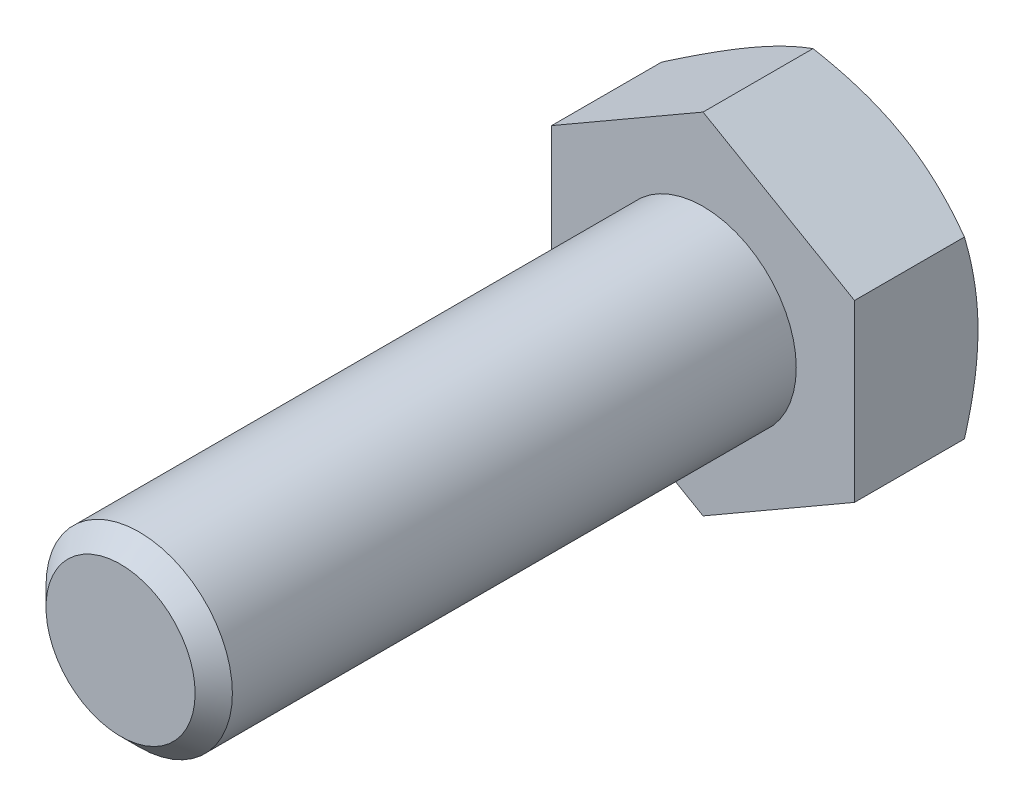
ISO-10303-21;
HEADER;
FILE_DESCRIPTION(('STEP AP214'),'2;1');
FILE_NAME('part.step','',(''),(''),'','','');
FILE_SCHEMA(('AUTOMOTIVE_DESIGN { 1 0 10303 214 1 1 1 1 }'));
ENDSEC;
DATA;
#1=APPLICATION_CONTEXT('core data for automotive mechanical design processes');
#2=APPLICATION_PROTOCOL_DEFINITION('international standard','automotive_design',2000,#1);
#3=PRODUCT_CONTEXT('',#1,'mechanical');
#4=PRODUCT('Part','Part','',(#3));
#5=PRODUCT_RELATED_PRODUCT_CATEGORY('part','',(#4));
#6=PRODUCT_DEFINITION_FORMATION('','',#4);
#7=PRODUCT_DEFINITION_CONTEXT('part definition',#1,'design');
#8=PRODUCT_DEFINITION('design','',#6,#7);
#9=PRODUCT_DEFINITION_SHAPE('','',#8);
#10=(LENGTH_UNIT() NAMED_UNIT(*) SI_UNIT(.MILLI.,.METRE.));
#11=(NAMED_UNIT(*) PLANE_ANGLE_UNIT() SI_UNIT($,.RADIAN.));
#12=(NAMED_UNIT(*) SI_UNIT($,.STERADIAN.) SOLID_ANGLE_UNIT());
#13=UNCERTAINTY_MEASURE_WITH_UNIT(LENGTH_MEASURE(1.E-05),#10,'distance_accuracy_value','');
#14=(GEOMETRIC_REPRESENTATION_CONTEXT(3) GLOBAL_UNCERTAINTY_ASSIGNED_CONTEXT((#13)) GLOBAL_UNIT_ASSIGNED_CONTEXT((#10,
#11,#12)) REPRESENTATION_CONTEXT('',''));
#15=CARTESIAN_POINT('',(0.,0.,0.));
#16=DIRECTION('',(0.,0.,1.));
#17=DIRECTION('',(1.,0.,0.));
#18=AXIS2_PLACEMENT_3D('',#15,#16,#17);
#19=CARTESIAN_POINT('',(0.,0.,25.));
#20=DIRECTION('',(0.,0.,1.));
#21=DIRECTION('',(1.,0.,0.));
#22=AXIS2_PLACEMENT_3D('',#19,#20,#21);
#23=PLANE('',#22);
#24=CARTESIAN_POINT('',(0.,0.,25.));
#25=DIRECTION('',(0.,0.,1.));
#26=DIRECTION('',(1.,0.,0.));
#27=AXIS2_PLACEMENT_3D('',#24,#25,#26);
#28=CIRCLE('',#27,3.2);
#29=CARTESIAN_POINT('',(3.20000000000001,0.,25.));
#30=VERTEX_POINT('',#29);
#31=EDGE_CURVE('E205',#30,#30,#28,.T.);
#32=ORIENTED_EDGE('',*,*,#31,.T.);
#33=EDGE_LOOP('',(#32));
#34=FACE_BOUND('',#33,.T.);
#35=ADVANCED_FACE('F31',(#34),#23,.T.);
#36=CARTESIAN_POINT('',(0.,0.,0.));
#37=DIRECTION('',(0.,0.,1.));
#38=DIRECTION('',(1.,0.,0.));
#39=AXIS2_PLACEMENT_3D('',#36,#37,#38);
#40=CYLINDRICAL_SURFACE('',#39,4.);
#41=CARTESIAN_POINT('',(0.,0.,24.2));
#42=DIRECTION('',(0.,0.,1.));
#43=DIRECTION('',(1.,0.,0.));
#44=AXIS2_PLACEMENT_3D('',#41,#42,#43);
#45=CIRCLE('',#44,4.);
#46=CARTESIAN_POINT('',(4.,0.,24.2));
#47=VERTEX_POINT('',#46);
#48=EDGE_CURVE('E207',#47,#47,#45,.F.);
#49=ORIENTED_EDGE('',*,*,#48,.T.);
#50=EDGE_LOOP('',(#49));
#51=FACE_BOUND('',#50,.T.);
#52=CARTESIAN_POINT('',(0.,0.,0.));
#53=DIRECTION('',(0.,0.,1.));
#54=DIRECTION('',(1.,0.,0.));
#55=AXIS2_PLACEMENT_3D('',#52,#53,#54);
#56=CIRCLE('',#55,4.);
#57=CARTESIAN_POINT('',(4.,0.,0.));
#58=VERTEX_POINT('',#57);
#59=EDGE_CURVE('E208',#58,#58,#56,.F.);
#60=ORIENTED_EDGE('',*,*,#59,.F.);
#61=EDGE_LOOP('',(#60));
#62=FACE_BOUND('',#61,.T.);
#63=ADVANCED_FACE('F196',(#51,#62),#40,.T.);
#64=CARTESIAN_POINT('',(0.,0.,25.));
#65=DIRECTION('',(0.,0.,-1.));
#66=DIRECTION('',(-1.,0.,0.));
#67=AXIS2_PLACEMENT_3D('',#64,#65,#66);
#68=CONICAL_SURFACE('',#67,3.2,0.785398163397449);
#69=ORIENTED_EDGE('',*,*,#48,.F.);
#70=EDGE_LOOP('',(#69));
#71=FACE_BOUND('',#70,.T.);
#72=ORIENTED_EDGE('',*,*,#31,.F.);
#73=EDGE_LOOP('',(#72));
#74=FACE_BOUND('',#73,.T.);
#75=ADVANCED_FACE('F201',(#71,#74),#68,.T.);
#76=CARTESIAN_POINT('',(0.,7.50555349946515,-5.3));
#77=DIRECTION('',(0.499999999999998,0.86602540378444,0.));
#78=DIRECTION('',(-0.86602540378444,0.499999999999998,0.));
#79=AXIS2_PLACEMENT_3D('',#76,#77,#78);
#80=PLANE('',#79);
#81=CARTESIAN_POINT('',(-0.000200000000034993,7.50566896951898,-4.71937674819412));
#82=CARTESIAN_POINT('',(0.142677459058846,7.42317863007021,-4.76699557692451));
#83=CARTESIAN_POINT('',(0.286087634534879,7.34038072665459,-4.81245329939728));
#84=CARTESIAN_POINT('',(0.574072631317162,7.17411251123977,-4.89845131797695));
#85=CARTESIAN_POINT('',(0.718647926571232,7.09064192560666,-4.93898949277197));
#86=CARTESIAN_POINT('',(1.15468865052,6.8388936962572,-5.05242899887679));
#87=CARTESIAN_POINT('',(1.44787528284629,6.66962231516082,-5.11695219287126));
#88=CARTESIAN_POINT('',(1.88662374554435,6.41631077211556,-5.19261341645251));
#89=CARTESIAN_POINT('',(2.03087463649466,6.33302748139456,-5.21416714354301));
#90=CARTESIAN_POINT('',(2.32002821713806,6.16608458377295,-5.25030968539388));
#91=CARTESIAN_POINT('',(2.46493084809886,6.08242501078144,-5.26489911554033));
#92=CARTESIAN_POINT('',(2.7549877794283,5.91496056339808,-5.28674124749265));
#93=CARTESIAN_POINT('',(2.90014160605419,5.83115596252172,-5.29400227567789));
#94=CARTESIAN_POINT('',(3.19057533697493,5.66347396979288,-5.30103969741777));
#95=CARTESIAN_POINT('',(3.33585523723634,5.57959658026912,-5.30081632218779));
#96=CARTESIAN_POINT('',(3.73387594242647,5.34979921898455,-5.28991654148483));
#97=CARTESIAN_POINT('',(3.98648646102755,5.20395446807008,-5.27161818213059));
#98=CARTESIAN_POINT('',(4.49002967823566,4.91323365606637,-5.21359365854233));
#99=CARTESIAN_POINT('',(4.74096060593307,4.76835861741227,-5.17384766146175));
#100=CARTESIAN_POINT('',(5.24551722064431,4.47705272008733,-5.07449409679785));
#101=CARTESIAN_POINT('',(5.49907924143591,4.33065861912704,-5.01446557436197));
#102=CARTESIAN_POINT('',(6.00242193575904,4.04005357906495,-4.87822500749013));
#103=CARTESIAN_POINT('',(6.25220905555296,3.89583891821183,-4.8020449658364));
#104=CARTESIAN_POINT('',(6.5002,3.75266127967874,-4.71937674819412));
#105=B_SPLINE_CURVE_WITH_KNOTS('',3,(#81,#82,#83,#84,#85,#86,#87,#88,#89,#90,#91,#92,#93,#94,
#95,#96,#97,#98,#99,#100,#101,#102,#103,#104),.UNSPECIFIED.,.F.,.F.,(4,2,2,2,2,2,2,2,2,2,2,4),
(0.,0.51510505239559,1.03043143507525,2.06322554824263,2.56697389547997,3.07067772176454,
3.57380860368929,4.07692394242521,4.95279354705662,5.82947446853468,6.72559912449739,
7.61996451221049),.UNSPECIFIED.);
#106=CARTESIAN_POINT('',(0.,7.50555349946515,-4.71944341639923));
#107=VERTEX_POINT('',#106);
#108=CARTESIAN_POINT('',(3.24999999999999,5.62916512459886,-5.3));
#109=VERTEX_POINT('',#108);
#110=EDGE_CURVE('E241',#107,#109,#105,.T.);
#111=ORIENTED_EDGE('',*,*,#110,.F.);
#112=DIRECTION('',(0.,0.,1.));
#113=VECTOR('',#112,1.);
#114=CARTESIAN_POINT('',(0.,7.50555349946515,-5.3));
#115=LINE('',#114,#113);
#116=CARTESIAN_POINT('',(0.,7.50555349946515,0.));
#117=VERTEX_POINT('',#116);
#118=EDGE_CURVE('E215',#107,#117,#115,.T.);
#119=ORIENTED_EDGE('',*,*,#118,.T.);
#120=DIRECTION('',(-0.86602540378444,0.499999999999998,0.));
#121=VECTOR('',#120,1.);
#122=CARTESIAN_POINT('',(0.,7.50555349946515,0.));
#123=LINE('',#122,#121);
#124=CARTESIAN_POINT('',(6.5,3.75277674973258,0.));
#125=VERTEX_POINT('',#124);
#126=EDGE_CURVE('E239',#125,#117,#123,.T.);
#127=ORIENTED_EDGE('',*,*,#126,.F.);
#128=DIRECTION('',(0.,0.,1.));
#129=VECTOR('',#128,1.);
#130=CARTESIAN_POINT('',(6.5,3.75277674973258,-5.3));
#131=LINE('',#130,#129);
#132=CARTESIAN_POINT('',(6.5,3.75277674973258,-4.71944341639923));
#133=VERTEX_POINT('',#132);
#134=EDGE_CURVE('E212',#133,#125,#131,.T.);
#135=ORIENTED_EDGE('',*,*,#134,.F.);
#136=EDGE_CURVE('E171',#109,#133,#105,.T.);
#137=ORIENTED_EDGE('',*,*,#136,.F.);
#138=EDGE_LOOP('',(#111,#119,#127,#135,#137));
#139=FACE_BOUND('',#138,.T.);
#140=ADVANCED_FACE('F181',(#139),#80,.T.);
#141=CARTESIAN_POINT('',(6.5,-3.75277674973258,-5.3));
#142=DIRECTION('',(1.,0.,0.));
#143=DIRECTION('',(0.,0.,-1.));
#144=AXIS2_PLACEMENT_3D('',#141,#142,#143);
#145=PLANE('',#144);
#146=CARTESIAN_POINT('',(6.5,-10.2428264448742,-2.04883753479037));
#147=CARTESIAN_POINT('',(6.5,-9.95749123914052,-2.18789595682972));
#148=CARTESIAN_POINT('',(6.5,-9.67151814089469,-2.32566707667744));
#149=CARTESIAN_POINT('',(6.5,-9.09795746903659,-2.59791370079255));
#150=CARTESIAN_POINT('',(6.5,-8.81036966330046,-2.73238871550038));
#151=CARTESIAN_POINT('',(6.5,-8.23183597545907,-2.99796413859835));
#152=CARTESIAN_POINT('',(6.5,-7.94088042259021,-3.12904355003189));
#153=CARTESIAN_POINT('',(6.5,-7.35671087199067,-3.38604980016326));
#154=CARTESIAN_POINT('',(6.5,-7.06349697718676,-3.51197687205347));
#155=CARTESIAN_POINT('',(6.5,-6.46434920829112,-3.7614858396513));
#156=CARTESIAN_POINT('',(6.5,-6.15832132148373,-3.8848431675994));
#157=CARTESIAN_POINT('',(6.5,-5.54274557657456,-4.12260875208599));
#158=CARTESIAN_POINT('',(6.5,-5.23319733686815,-4.2370160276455));
#159=CARTESIAN_POINT('',(6.5,-4.61061796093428,-4.45399730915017));
#160=CARTESIAN_POINT('',(6.5,-4.29759477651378,-4.55659391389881));
#161=CARTESIAN_POINT('',(6.5,-3.66705774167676,-4.74676876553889));
#162=CARTESIAN_POINT('',(6.5,-3.34954528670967,-4.83435157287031));
#163=CARTESIAN_POINT('',(6.5,-2.71162315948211,-4.98994277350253));
#164=CARTESIAN_POINT('',(6.5,-2.3912406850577,-5.05806094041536));
#165=CARTESIAN_POINT('',(6.5,-1.74628166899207,-5.17096432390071));
#166=CARTESIAN_POINT('',(6.5,-1.4217055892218,-5.2157520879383));
#167=CARTESIAN_POINT('',(6.5,-0.935153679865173,-5.26247031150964));
#168=CARTESIAN_POINT('',(6.5,-0.774120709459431,-5.27461755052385));
#169=CARTESIAN_POINT('',(6.5,-0.451677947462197,-5.29209027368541));
#170=CARTESIAN_POINT('',(6.5,-0.290268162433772,-5.29741587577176));
#171=CARTESIAN_POINT('',(6.5,0.032631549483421,-5.30111032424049));
#172=CARTESIAN_POINT('',(6.5,0.194121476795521,-5.29947913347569));
#173=CARTESIAN_POINT('',(6.5,0.516885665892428,-5.28930353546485));
#174=CARTESIAN_POINT('',(6.5,0.678159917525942,-5.2807588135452));
#175=CARTESIAN_POINT('',(6.5,1.06087214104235,-5.2524625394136));
#176=CARTESIAN_POINT('',(6.5,1.28209274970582,-5.22970222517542));
#177=CARTESIAN_POINT('',(6.5,1.72298724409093,-5.17237790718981));
#178=CARTESIAN_POINT('',(6.5,1.94266093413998,-5.13781243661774));
#179=CARTESIAN_POINT('',(6.5,2.59905068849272,-5.01823337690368));
#180=CARTESIAN_POINT('',(6.5,3.03292018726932,-4.91735524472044));
#181=CARTESIAN_POINT('',(6.5,3.68203059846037,-4.74117763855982));
#182=CARTESIAN_POINT('',(6.5,3.90060192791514,-4.67743243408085));
#183=CARTESIAN_POINT('',(6.5,4.33562456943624,-4.54301317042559));
#184=CARTESIAN_POINT('',(6.5,4.55207586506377,-4.47233905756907));
#185=CARTESIAN_POINT('',(6.5,4.98292314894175,-4.3252213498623));
#186=CARTESIAN_POINT('',(6.5,5.19731969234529,-4.24877936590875));
#187=CARTESIAN_POINT('',(6.5,5.6243136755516,-4.09105605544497));
#188=CARTESIAN_POINT('',(6.5,5.8369111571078,-4.00977484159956));
#189=CARTESIAN_POINT('',(6.5,6.41107024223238,-3.78396124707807));
#190=CARTESIAN_POINT('',(6.5,6.77109993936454,-3.63553740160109));
#191=CARTESIAN_POINT('',(6.5,7.48742894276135,-3.32991367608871));
#192=CARTESIAN_POINT('',(6.5,7.84372782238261,-3.17271280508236));
#193=CARTESIAN_POINT('',(6.5,8.55345570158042,-2.85162072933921));
#194=CARTESIAN_POINT('',(6.5,8.90688352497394,-2.68772693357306));
#195=CARTESIAN_POINT('',(6.5,9.61131133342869,-2.35485675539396));
#196=CARTESIAN_POINT('',(6.5,9.96231141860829,-2.18588058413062));
#197=CARTESIAN_POINT('',(6.5,10.6629371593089,-1.84367823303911));
#198=CARTESIAN_POINT('',(6.5,11.012559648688,-1.67044558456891));
#199=CARTESIAN_POINT('',(6.5,11.7102232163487,-1.32082260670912));
#200=CARTESIAN_POINT('',(6.5,12.058264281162,-1.14443225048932));
#201=CARTESIAN_POINT('',(6.5,12.7529700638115,-0.789156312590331));
#202=CARTESIAN_POINT('',(6.5,13.099635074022,-0.610271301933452));
#203=CARTESIAN_POINT('',(6.5,13.7918918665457,-0.250435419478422));
#204=CARTESIAN_POINT('',(6.5,14.1374836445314,-0.0694845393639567));
#205=CARTESIAN_POINT('',(6.5,15.099399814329,0.437179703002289));
#206=CARTESIAN_POINT('',(6.5,15.7147468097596,0.764748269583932));
#207=CARTESIAN_POINT('',(6.5,16.9433793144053,1.42381233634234));
#208=CARTESIAN_POINT('',(6.5,17.5566646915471,1.7553080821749));
#209=CARTESIAN_POINT('',(6.5,18.7795711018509,2.4200871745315));
#210=CARTESIAN_POINT('',(6.5,19.389197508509,2.75336064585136));
#211=CARTESIAN_POINT('',(6.5,20.6071616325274,3.42213981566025));
#212=CARTESIAN_POINT('',(6.5,21.2154994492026,3.75764533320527));
#213=CARTESIAN_POINT('',(6.5,21.8233856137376,4.09396124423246));
#214=B_SPLINE_CURVE_WITH_KNOTS('',3,(#146,#147,#148,#149,#150,#151,#152,#153,#154,#155,#156,
#157,#158,#159,#160,#161,#162,#163,#164,#165,#166,#167,#168,#169,#170,#171,#172,#173,#174,#175,
#176,#177,#178,#179,#180,#181,#182,#183,#184,#185,#186,#187,#188,#189,#190,#191,#192,#193,#194,
#195,#196,#197,#198,#199,#200,#201,#202,#203,#204,#205,#206,#207,#208,#209,#210,#211,#212,#213),
.UNSPECIFIED.,.F.,.F.,(4,2,2,2,2,2,2,2,2,2,2,2,2,2,2,2,2,2,2,2,2,2,2,2,2,2,2,2,2,2,2,2,2,4),(0.,
0.952261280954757,1.90466315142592,2.8619801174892,3.81925370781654,4.8090096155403,
5.798873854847,6.78681142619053,7.77444837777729,8.75640022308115,9.7382448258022,
10.2225937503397,10.7069343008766,11.1912774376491,11.6756426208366,12.3424346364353,
13.0093095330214,14.3437044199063,15.0266742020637,15.7096492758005,16.3924343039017,
17.0752034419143,18.2433007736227,19.4115302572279,20.580216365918,21.748853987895,
22.9193933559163,24.0899426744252,25.2602283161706,26.4305186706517,28.5218066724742,
30.6132261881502,32.6975528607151,34.7817125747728),.UNSPECIFIED.);
#215=CARTESIAN_POINT('',(6.5,0.,-5.3));
#216=VERTEX_POINT('',#215);
#217=EDGE_CURVE('E169',#133,#216,#214,.F.);
#218=ORIENTED_EDGE('',*,*,#217,.F.);
#219=ORIENTED_EDGE('',*,*,#134,.T.);
#220=DIRECTION('',(0.,1.,0.));
#221=VECTOR('',#220,1.);
#222=CARTESIAN_POINT('',(6.5,-3.75277674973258,0.));
#223=LINE('',#222,#221);
#224=CARTESIAN_POINT('',(6.5,-3.75277674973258,0.));
#225=VERTEX_POINT('',#224);
#226=EDGE_CURVE('E217',#225,#125,#223,.T.);
#227=ORIENTED_EDGE('',*,*,#226,.F.);
#228=DIRECTION('',(0.,0.,1.));
#229=VECTOR('',#228,1.);
#230=CARTESIAN_POINT('',(6.5,-3.75277674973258,-5.3));
#231=LINE('',#230,#229);
#232=CARTESIAN_POINT('',(6.5,-3.75277674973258,-4.71944341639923));
#233=VERTEX_POINT('',#232);
#234=EDGE_CURVE('E223',#233,#225,#231,.T.);
#235=ORIENTED_EDGE('',*,*,#234,.F.);
#236=EDGE_CURVE('E164',#216,#233,#214,.F.);
#237=ORIENTED_EDGE('',*,*,#236,.F.);
#238=EDGE_LOOP('',(#218,#219,#227,#235,#237));
#239=FACE_BOUND('',#238,.T.);
#240=ADVANCED_FACE('F177',(#239),#145,.T.);
#241=CARTESIAN_POINT('',(0.,-7.50555349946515,-5.3));
#242=DIRECTION('',(0.499999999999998,-0.86602540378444,0.));
#243=DIRECTION('',(0.86602540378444,0.499999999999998,0.));
#244=AXIS2_PLACEMENT_3D('',#241,#242,#243);
#245=PLANE('',#244);
#246=CARTESIAN_POINT('',(6.5002,-3.75266127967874,-4.71937674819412));
#247=CARTESIAN_POINT('',(6.35732254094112,-3.83515161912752,-4.76699557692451));
#248=CARTESIAN_POINT('',(6.21391236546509,-3.91794952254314,-4.81245329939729));
#249=CARTESIAN_POINT('',(5.9259273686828,-4.08421773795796,-4.89845131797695));
#250=CARTESIAN_POINT('',(5.78135207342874,-4.16768832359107,-4.93898949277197));
#251=CARTESIAN_POINT('',(5.34531134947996,-4.41943655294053,-5.05242899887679));
#252=CARTESIAN_POINT('',(5.05212471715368,-4.58870793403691,-5.11695219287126));
#253=CARTESIAN_POINT('',(4.61337625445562,-4.84201947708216,-5.19261341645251));
#254=CARTESIAN_POINT('',(4.4691253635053,-4.92530276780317,-5.21416714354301));
#255=CARTESIAN_POINT('',(4.1799717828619,-5.09224566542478,-5.25030968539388));
#256=CARTESIAN_POINT('',(4.0350691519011,-5.17590523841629,-5.26489911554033));
#257=CARTESIAN_POINT('',(3.74501222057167,-5.34336968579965,-5.28674124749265));
#258=CARTESIAN_POINT('',(3.59985839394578,-5.42717428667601,-5.29400227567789));
#259=CARTESIAN_POINT('',(3.30942466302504,-5.59485627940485,-5.30103969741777));
#260=CARTESIAN_POINT('',(3.16414476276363,-5.67873366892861,-5.3008163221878));
#261=CARTESIAN_POINT('',(2.76612405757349,-5.90853103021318,-5.28991654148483));
#262=CARTESIAN_POINT('',(2.51351353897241,-6.05437578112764,-5.27161818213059));
#263=CARTESIAN_POINT('',(2.0099703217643,-6.34509659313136,-5.21359365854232));
#264=CARTESIAN_POINT('',(1.7590393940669,-6.48997163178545,-5.17384766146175));
#265=CARTESIAN_POINT('',(1.25448277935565,-6.78127752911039,-5.07449409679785));
#266=CARTESIAN_POINT('',(1.00092075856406,-6.92767163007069,-5.01446557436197));
#267=CARTESIAN_POINT('',(0.497578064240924,-7.21827667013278,-4.87822500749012));
#268=CARTESIAN_POINT('',(0.247790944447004,-7.3624913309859,-4.8020449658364));
#269=CARTESIAN_POINT('',(-0.000200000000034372,-7.50566896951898,-4.71937674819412));
#270=B_SPLINE_CURVE_WITH_KNOTS('',3,(#246,#247,#248,#249,#250,#251,#252,#253,#254,#255,#256,
#257,#258,#259,#260,#261,#262,#263,#264,#265,#266,#267,#268,#269),.UNSPECIFIED.,.F.,.F.,(4,2,2,
2,2,2,2,2,2,2,2,4),(0.,0.515105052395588,1.03043143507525,2.06322554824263,2.56697389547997,
3.07067772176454,3.57380860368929,4.07692394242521,4.95279354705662,5.82947446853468,
6.72559912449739,7.61996451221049),.UNSPECIFIED.);
#271=CARTESIAN_POINT('',(3.24999999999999,-5.62916512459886,-5.3));
#272=VERTEX_POINT('',#271);
#273=EDGE_CURVE('E170',#233,#272,#270,.T.);
#274=ORIENTED_EDGE('',*,*,#273,.F.);
#275=ORIENTED_EDGE('',*,*,#234,.T.);
#276=DIRECTION('',(0.86602540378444,0.499999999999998,0.));
#277=VECTOR('',#276,1.);
#278=CARTESIAN_POINT('',(0.,-7.50555349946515,0.));
#279=LINE('',#278,#277);
#280=CARTESIAN_POINT('',(0.,-7.50555349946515,0.));
#281=VERTEX_POINT('',#280);
#282=EDGE_CURVE('E228',#281,#225,#279,.T.);
#283=ORIENTED_EDGE('',*,*,#282,.F.);
#284=DIRECTION('',(0.,0.,1.));
#285=VECTOR('',#284,1.);
#286=CARTESIAN_POINT('',(0.,-7.50555349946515,-5.3));
#287=LINE('',#286,#285);
#288=CARTESIAN_POINT('',(0.,-7.50555349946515,-4.71944341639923));
#289=VERTEX_POINT('',#288);
#290=EDGE_CURVE('E221',#289,#281,#287,.T.);
#291=ORIENTED_EDGE('',*,*,#290,.F.);
#292=EDGE_CURVE('E158',#272,#289,#270,.T.);
#293=ORIENTED_EDGE('',*,*,#292,.F.);
#294=EDGE_LOOP('',(#274,#275,#283,#291,#293));
#295=FACE_BOUND('',#294,.T.);
#296=ADVANCED_FACE('F180',(#295),#245,.T.);
#297=CARTESIAN_POINT('',(0.,-7.50555349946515,-5.3));
#298=DIRECTION('',(-0.500000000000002,-0.866025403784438,0.));
#299=DIRECTION('',(0.866025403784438,-0.500000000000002,0.));
#300=AXIS2_PLACEMENT_3D('',#297,#298,#299);
#301=PLANE('',#300);
#302=CARTESIAN_POINT('',(0.000199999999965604,-7.50566896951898,-4.71937674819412));
#303=CARTESIAN_POINT('',(-0.142677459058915,-7.42317863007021,-4.7669955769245));
#304=CARTESIAN_POINT('',(-0.286087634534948,-7.34038072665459,-4.81245329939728));
#305=CARTESIAN_POINT('',(-0.57407263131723,-7.17411251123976,-4.89845131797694));
#306=CARTESIAN_POINT('',(-0.718647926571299,-7.09064192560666,-4.93898949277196));
#307=CARTESIAN_POINT('',(-1.15468865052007,-6.83889369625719,-5.05242899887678));
#308=CARTESIAN_POINT('',(-1.44787528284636,-6.66962231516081,-5.11695219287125));
#309=CARTESIAN_POINT('',(-1.88662374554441,-6.41631077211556,-5.1926134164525));
#310=CARTESIAN_POINT('',(-2.03087463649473,-6.33302748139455,-5.214167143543));
#311=CARTESIAN_POINT('',(-2.32002821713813,-6.16608458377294,-5.25030968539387));
#312=CARTESIAN_POINT('',(-2.46493084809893,-6.08242501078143,-5.26489911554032));
#313=CARTESIAN_POINT('',(-2.75498777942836,-5.91496056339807,-5.28674124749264));
#314=CARTESIAN_POINT('',(-2.90014160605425,-5.8311559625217,-5.29400227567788));
#315=CARTESIAN_POINT('',(-3.19057533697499,-5.66347396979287,-5.30103969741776));
#316=CARTESIAN_POINT('',(-3.3358552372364,-5.5795965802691,-5.30081632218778));
#317=CARTESIAN_POINT('',(-3.73387594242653,-5.34979921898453,-5.28991654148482));
#318=CARTESIAN_POINT('',(-3.98648646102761,-5.20395446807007,-5.27161818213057));
#319=CARTESIAN_POINT('',(-4.49002967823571,-4.91323365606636,-5.21359365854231));
#320=CARTESIAN_POINT('',(-4.74096060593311,-4.76835861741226,-5.17384766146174));
#321=CARTESIAN_POINT('',(-5.24551722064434,-4.47705272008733,-5.07449409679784));
#322=CARTESIAN_POINT('',(-5.49907924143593,-4.33065861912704,-5.01446557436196));
#323=CARTESIAN_POINT('',(-6.00242193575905,-4.04005357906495,-4.87822500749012));
#324=CARTESIAN_POINT('',(-6.25220905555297,-3.89583891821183,-4.8020449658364));
#325=CARTESIAN_POINT('',(-6.5002,-3.75266127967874,-4.71937674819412));
#326=B_SPLINE_CURVE_WITH_KNOTS('',3,(#302,#303,#304,#305,#306,#307,#308,#309,#310,#311,#312,
#313,#314,#315,#316,#317,#318,#319,#320,#321,#322,#323,#324,#325),.UNSPECIFIED.,.F.,.F.,(4,2,2,
2,2,2,2,2,2,2,2,4),(0.,0.515105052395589,1.03043143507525,2.06322554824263,2.56697389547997,
3.07067772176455,3.57380860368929,4.07692394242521,4.9527935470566,5.82947446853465,
6.72559912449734,7.61996451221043),.UNSPECIFIED.);
#327=CARTESIAN_POINT('',(-3.25000000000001,-5.62916512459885,-5.3));
#328=VERTEX_POINT('',#327);
#329=EDGE_CURVE('E260',#289,#328,#326,.T.);
#330=ORIENTED_EDGE('',*,*,#329,.F.);
#331=ORIENTED_EDGE('',*,*,#290,.T.);
#332=DIRECTION('',(0.866025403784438,-0.500000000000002,0.));
#333=VECTOR('',#332,1.);
#334=CARTESIAN_POINT('',(0.,-7.50555349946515,0.));
#335=LINE('',#334,#333);
#336=CARTESIAN_POINT('',(-6.5,-3.75277674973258,0.));
#337=VERTEX_POINT('',#336);
#338=EDGE_CURVE('E231',#337,#281,#335,.T.);
#339=ORIENTED_EDGE('',*,*,#338,.F.);
#340=DIRECTION('',(0.,0.,1.));
#341=VECTOR('',#340,1.);
#342=CARTESIAN_POINT('',(-6.5,-3.75277674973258,-5.3));
#343=LINE('',#342,#341);
#344=CARTESIAN_POINT('',(-6.5,-3.75277674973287,-4.71944341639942));
#345=VERTEX_POINT('',#344);
#346=EDGE_CURVE('E219',#345,#337,#343,.T.);
#347=ORIENTED_EDGE('',*,*,#346,.F.);
#348=EDGE_CURVE('E107',#328,#345,#326,.T.);
#349=ORIENTED_EDGE('',*,*,#348,.F.);
#350=EDGE_LOOP('',(#330,#331,#339,#347,#349));
#351=FACE_BOUND('',#350,.T.);
#352=ADVANCED_FACE('F185',(#351),#301,.T.);
#353=CARTESIAN_POINT('',(-6.5,-3.75277674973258,-5.3));
#354=DIRECTION('',(-1.,0.,0.));
#355=DIRECTION('',(0.,0.,1.));
#356=AXIS2_PLACEMENT_3D('',#353,#354,#355);
#357=PLANE('',#356);
#358=CARTESIAN_POINT('',(-6.5,-10.2428264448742,-2.04883753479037));
#359=CARTESIAN_POINT('',(-6.5,-9.95749123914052,-2.18789595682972));
#360=CARTESIAN_POINT('',(-6.5,-9.67151814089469,-2.32566707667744));
#361=CARTESIAN_POINT('',(-6.5,-9.09795746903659,-2.59791370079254));
#362=CARTESIAN_POINT('',(-6.5,-8.81036966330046,-2.73238871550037));
#363=CARTESIAN_POINT('',(-6.5,-8.23183597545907,-2.99796413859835));
#364=CARTESIAN_POINT('',(-6.5,-7.94088042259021,-3.12904355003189));
#365=CARTESIAN_POINT('',(-6.5,-7.35671087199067,-3.38604980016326));
#366=CARTESIAN_POINT('',(-6.5,-7.06349697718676,-3.51197687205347));
#367=CARTESIAN_POINT('',(-6.5,-6.46434920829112,-3.7614858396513));
#368=CARTESIAN_POINT('',(-6.5,-6.15832132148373,-3.88484316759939));
#369=CARTESIAN_POINT('',(-6.5,-5.54274557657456,-4.12260875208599));
#370=CARTESIAN_POINT('',(-6.5,-5.23319733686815,-4.2370160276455));
#371=CARTESIAN_POINT('',(-6.5,-4.61061796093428,-4.45399730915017));
#372=CARTESIAN_POINT('',(-6.5,-4.29759477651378,-4.5565939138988));
#373=CARTESIAN_POINT('',(-6.5,-3.66705774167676,-4.74676876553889));
#374=CARTESIAN_POINT('',(-6.5,-3.34954528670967,-4.83435157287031));
#375=CARTESIAN_POINT('',(-6.5,-2.71162315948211,-4.98994277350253));
#376=CARTESIAN_POINT('',(-6.5,-2.3912406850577,-5.05806094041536));
#377=CARTESIAN_POINT('',(-6.5,-1.74628166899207,-5.17096432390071));
#378=CARTESIAN_POINT('',(-6.5,-1.4217055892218,-5.2157520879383));
#379=CARTESIAN_POINT('',(-6.5,-0.935153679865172,-5.26247031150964));
#380=CARTESIAN_POINT('',(-6.5,-0.77412070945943,-5.27461755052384));
#381=CARTESIAN_POINT('',(-6.5,-0.451677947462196,-5.29209027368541));
#382=CARTESIAN_POINT('',(-6.5,-0.290268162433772,-5.29741587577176));
#383=CARTESIAN_POINT('',(-6.5,0.0326315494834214,-5.30111032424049));
#384=CARTESIAN_POINT('',(-6.5,0.194121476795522,-5.29947913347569));
#385=CARTESIAN_POINT('',(-6.5,0.516885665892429,-5.28930353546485));
#386=CARTESIAN_POINT('',(-6.5,0.678159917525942,-5.2807588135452));
#387=CARTESIAN_POINT('',(-6.5,1.06087214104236,-5.2524625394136));
#388=CARTESIAN_POINT('',(-6.5,1.28209274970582,-5.22970222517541));
#389=CARTESIAN_POINT('',(-6.5,1.72298724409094,-5.17237790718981));
#390=CARTESIAN_POINT('',(-6.5,1.94266093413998,-5.13781243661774));
#391=CARTESIAN_POINT('',(-6.5,2.59905068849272,-5.01823337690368));
#392=CARTESIAN_POINT('',(-6.5,3.03292018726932,-4.91735524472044));
#393=CARTESIAN_POINT('',(-6.5,3.68203059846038,-4.74117763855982));
#394=CARTESIAN_POINT('',(-6.5,3.90060192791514,-4.67743243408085));
#395=CARTESIAN_POINT('',(-6.5,4.33562456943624,-4.54301317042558));
#396=CARTESIAN_POINT('',(-6.5,4.55207586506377,-4.47233905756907));
#397=CARTESIAN_POINT('',(-6.5,4.98292314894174,-4.3252213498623));
#398=CARTESIAN_POINT('',(-6.5,5.19731969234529,-4.24877936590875));
#399=CARTESIAN_POINT('',(-6.5,5.6243136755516,-4.09105605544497));
#400=CARTESIAN_POINT('',(-6.5,5.8369111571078,-4.00977484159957));
#401=CARTESIAN_POINT('',(-6.5,6.41107024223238,-3.78396124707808));
#402=CARTESIAN_POINT('',(-6.5,6.77109993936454,-3.63553740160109));
#403=CARTESIAN_POINT('',(-6.5,7.48742894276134,-3.32991367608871));
#404=CARTESIAN_POINT('',(-6.5,7.8437278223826,-3.17271280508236));
#405=CARTESIAN_POINT('',(-6.5,8.55345570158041,-2.85162072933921));
#406=CARTESIAN_POINT('',(-6.5,8.90688352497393,-2.68772693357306));
#407=CARTESIAN_POINT('',(-6.5,9.61131133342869,-2.35485675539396));
#408=CARTESIAN_POINT('',(-6.5,9.96231141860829,-2.18588058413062));
#409=CARTESIAN_POINT('',(-6.5,10.6629371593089,-1.84367823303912));
#410=CARTESIAN_POINT('',(-6.5,11.0125596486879,-1.67044558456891));
#411=CARTESIAN_POINT('',(-6.5,11.7102232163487,-1.32082260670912));
#412=CARTESIAN_POINT('',(-6.5,12.058264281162,-1.14443225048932));
#413=CARTESIAN_POINT('',(-6.5,12.7529700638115,-0.789156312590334));
#414=CARTESIAN_POINT('',(-6.5,13.099635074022,-0.610271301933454));
#415=CARTESIAN_POINT('',(-6.5,13.7918918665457,-0.250435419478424));
#416=CARTESIAN_POINT('',(-6.5,14.1374836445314,-0.0694845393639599));
#417=CARTESIAN_POINT('',(-6.5,15.099399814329,0.437179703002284));
#418=CARTESIAN_POINT('',(-6.5,15.7147468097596,0.764748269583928));
#419=CARTESIAN_POINT('',(-6.5,16.9433793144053,1.42381233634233));
#420=CARTESIAN_POINT('',(-6.5,17.5566646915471,1.75530808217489));
#421=CARTESIAN_POINT('',(-6.5,18.7795711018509,2.4200871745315));
#422=CARTESIAN_POINT('',(-6.5,19.389197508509,2.75336064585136));
#423=CARTESIAN_POINT('',(-6.5,20.6071616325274,3.42213981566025));
#424=CARTESIAN_POINT('',(-6.5,21.2154994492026,3.75764533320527));
#425=CARTESIAN_POINT('',(-6.5,21.8233856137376,4.09396124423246));
#426=B_SPLINE_CURVE_WITH_KNOTS('',3,(#358,#359,#360,#361,#362,#363,#364,#365,#366,#367,#368,
#369,#370,#371,#372,#373,#374,#375,#376,#377,#378,#379,#380,#381,#382,#383,#384,#385,#386,#387,
#388,#389,#390,#391,#392,#393,#394,#395,#396,#397,#398,#399,#400,#401,#402,#403,#404,#405,#406,
#407,#408,#409,#410,#411,#412,#413,#414,#415,#416,#417,#418,#419,#420,#421,#422,#423,#424,#425),
.UNSPECIFIED.,.F.,.F.,(4,2,2,2,2,2,2,2,2,2,2,2,2,2,2,2,2,2,2,2,2,2,2,2,2,2,2,2,2,2,2,2,2,4),(0.,
0.952261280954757,1.90466315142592,2.8619801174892,3.81925370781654,4.8090096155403,
5.79887385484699,6.78681142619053,7.77444837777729,8.75640022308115,9.7382448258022,
10.2225937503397,10.7069343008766,11.1912774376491,11.6756426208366,12.3424346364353,
13.0093095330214,14.3437044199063,15.0266742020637,15.7096492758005,16.3924343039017,
17.0752034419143,18.2433007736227,19.4115302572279,20.580216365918,21.748853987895,
22.9193933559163,24.0899426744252,25.2602283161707,26.4305186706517,28.5218066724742,
30.6132261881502,32.6975528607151,34.7817125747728),.UNSPECIFIED.);
#427=CARTESIAN_POINT('',(-6.5,0.,-5.3));
#428=VERTEX_POINT('',#427);
#429=EDGE_CURVE('E102',#345,#428,#426,.T.);
#430=ORIENTED_EDGE('',*,*,#429,.F.);
#431=ORIENTED_EDGE('',*,*,#346,.T.);
#432=DIRECTION('',(0.,-1.,0.));
#433=VECTOR('',#432,1.);
#434=CARTESIAN_POINT('',(-6.5,-3.75277674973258,0.));
#435=LINE('',#434,#433);
#436=CARTESIAN_POINT('',(-6.5,3.75277674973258,0.));
#437=VERTEX_POINT('',#436);
#438=EDGE_CURVE('E234',#437,#337,#435,.T.);
#439=ORIENTED_EDGE('',*,*,#438,.F.);
#440=DIRECTION('',(0.,0.,1.));
#441=VECTOR('',#440,1.);
#442=CARTESIAN_POINT('',(-6.5,3.75277674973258,-5.3));
#443=LINE('',#442,#441);
#444=CARTESIAN_POINT('',(-6.5,3.75277674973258,-4.71944341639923));
#445=VERTEX_POINT('',#444);
#446=EDGE_CURVE('E128',#445,#437,#443,.T.);
#447=ORIENTED_EDGE('',*,*,#446,.F.);
#448=EDGE_CURVE('E111',#428,#445,#426,.T.);
#449=ORIENTED_EDGE('',*,*,#448,.F.);
#450=EDGE_LOOP('',(#430,#431,#439,#447,#449));
#451=FACE_BOUND('',#450,.T.);
#452=ADVANCED_FACE('F126',(#451),#357,.T.);
#453=CARTESIAN_POINT('',(-6.5,3.75277674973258,-5.3));
#454=DIRECTION('',(-0.500000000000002,0.866025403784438,0.));
#455=DIRECTION('',(-0.866025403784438,-0.500000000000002,0.));
#456=AXIS2_PLACEMENT_3D('',#453,#454,#455);
#457=PLANE('',#456);
#458=CARTESIAN_POINT('',(-6.5002,3.75266127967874,-4.71937674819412));
#459=CARTESIAN_POINT('',(-6.35732254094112,3.83515161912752,-4.76699557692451));
#460=CARTESIAN_POINT('',(-6.21391236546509,3.91794952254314,-4.81245329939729));
#461=CARTESIAN_POINT('',(-5.92592736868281,4.08421773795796,-4.89845131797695));
#462=CARTESIAN_POINT('',(-5.78135207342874,4.16768832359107,-4.93898949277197));
#463=CARTESIAN_POINT('',(-5.34531134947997,4.41943655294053,-5.05242899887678));
#464=CARTESIAN_POINT('',(-5.05212471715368,4.58870793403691,-5.11695219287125));
#465=CARTESIAN_POINT('',(-4.61337625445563,4.84201947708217,-5.1926134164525));
#466=CARTESIAN_POINT('',(-4.46912536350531,4.92530276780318,-5.214167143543));
#467=CARTESIAN_POINT('',(-4.17997178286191,5.09224566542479,-5.25030968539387));
#468=CARTESIAN_POINT('',(-4.03506915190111,5.17590523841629,-5.26489911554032));
#469=CARTESIAN_POINT('',(-3.74501222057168,5.34336968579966,-5.28674124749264));
#470=CARTESIAN_POINT('',(-3.59985839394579,5.42717428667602,-5.29400227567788));
#471=CARTESIAN_POINT('',(-3.30942466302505,5.59485627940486,-5.30103969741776));
#472=CARTESIAN_POINT('',(-3.16414476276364,5.67873366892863,-5.30081632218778));
#473=CARTESIAN_POINT('',(-2.76612405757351,5.9085310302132,-5.28991654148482));
#474=CARTESIAN_POINT('',(-2.51351353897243,6.05437578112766,-5.27161818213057));
#475=CARTESIAN_POINT('',(-2.00997032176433,6.34509659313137,-5.21359365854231));
#476=CARTESIAN_POINT('',(-1.75903939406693,6.48997163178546,-5.17384766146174));
#477=CARTESIAN_POINT('',(-1.2544827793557,6.7812775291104,-5.07449409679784));
#478=CARTESIAN_POINT('',(-1.00092075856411,6.92767163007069,-5.01446557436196));
#479=CARTESIAN_POINT('',(-0.497578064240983,7.21827667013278,-4.87822500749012));
#480=CARTESIAN_POINT('',(-0.247790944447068,7.3624913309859,-4.8020449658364));
#481=CARTESIAN_POINT('',(0.000199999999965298,7.50566896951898,-4.71937674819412));
#482=B_SPLINE_CURVE_WITH_KNOTS('',3,(#458,#459,#460,#461,#462,#463,#464,#465,#466,#467,#468,
#469,#470,#471,#472,#473,#474,#475,#476,#477,#478,#479,#480,#481),.UNSPECIFIED.,.F.,.F.,(4,2,2,
2,2,2,2,2,2,2,2,4),(0.,0.515105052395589,1.03043143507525,2.06322554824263,2.56697389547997,
3.07067772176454,3.57380860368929,4.07692394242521,4.9527935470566,5.82947446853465,
6.72559912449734,7.61996451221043),.UNSPECIFIED.);
#483=CARTESIAN_POINT('',(-3.25000000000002,5.62916512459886,-5.3));
#484=VERTEX_POINT('',#483);
#485=EDGE_CURVE('E117',#445,#484,#482,.T.);
#486=ORIENTED_EDGE('',*,*,#485,.F.);
#487=ORIENTED_EDGE('',*,*,#446,.T.);
#488=DIRECTION('',(-0.866025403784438,-0.500000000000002,0.));
#489=VECTOR('',#488,1.);
#490=CARTESIAN_POINT('',(-6.5,3.75277674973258,0.));
#491=LINE('',#490,#489);
#492=EDGE_CURVE('E237',#117,#437,#491,.T.);
#493=ORIENTED_EDGE('',*,*,#492,.F.);
#494=ORIENTED_EDGE('',*,*,#118,.F.);
#495=EDGE_CURVE('E119',#484,#107,#482,.T.);
#496=ORIENTED_EDGE('',*,*,#495,.F.);
#497=EDGE_LOOP('',(#486,#487,#493,#494,#496));
#498=FACE_BOUND('',#497,.T.);
#499=ADVANCED_FACE('F193',(#498),#457,.T.);
#500=CARTESIAN_POINT('',(6.5,3.75277674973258,0.));
#501=DIRECTION('',(0.,0.,1.));
#502=DIRECTION('',(1.,0.,0.));
#503=AXIS2_PLACEMENT_3D('',#500,#501,#502);
#504=PLANE('',#503);
#505=ORIENTED_EDGE('',*,*,#59,.T.);
#506=EDGE_LOOP('',(#505));
#507=FACE_BOUND('',#506,.T.);
#508=ORIENTED_EDGE('',*,*,#126,.T.);
#509=ORIENTED_EDGE('',*,*,#492,.T.);
#510=ORIENTED_EDGE('',*,*,#438,.T.);
#511=ORIENTED_EDGE('',*,*,#338,.T.);
#512=ORIENTED_EDGE('',*,*,#282,.T.);
#513=ORIENTED_EDGE('',*,*,#226,.T.);
#514=EDGE_LOOP('',(#508,#509,#510,#511,#512,#513));
#515=FACE_BOUND('',#514,.T.);
#516=ADVANCED_FACE('F150',(#507,#515),#504,.T.);
#517=CARTESIAN_POINT('',(0.,0.,0.));
#518=DIRECTION('',(0.,0.,1.));
#519=DIRECTION('',(1.,0.,0.));
#520=AXIS2_PLACEMENT_3D('',#517,#518,#519);
#521=CONICAL_SURFACE('',#520,15.679869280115,1.0471975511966);
#522=ORIENTED_EDGE('',*,*,#136,.T.);
#523=ORIENTED_EDGE('',*,*,#217,.T.);
#524=CARTESIAN_POINT('',(0.,0.,-5.3));
#525=DIRECTION('',(0.,0.,1.));
#526=DIRECTION('',(1.,0.,0.));
#527=AXIS2_PLACEMENT_3D('',#524,#525,#526);
#528=CIRCLE('',#527,6.5);
#529=EDGE_CURVE('E34',#109,#216,#528,.F.);
#530=ORIENTED_EDGE('',*,*,#529,.F.);
#531=EDGE_LOOP('',(#522,#523,#530));
#532=FACE_BOUND('',#531,.T.);
#533=ADVANCED_FACE('F250',(#532),#521,.T.);
#534=ORIENTED_EDGE('',*,*,#110,.T.);
#535=EDGE_CURVE('E124',#484,#109,#528,.F.);
#536=ORIENTED_EDGE('',*,*,#535,.F.);
#537=ORIENTED_EDGE('',*,*,#495,.T.);
#538=EDGE_LOOP('',(#534,#536,#537));
#539=FACE_BOUND('',#538,.T.);
#540=ADVANCED_FACE('F149',(#539),#521,.T.);
#541=ORIENTED_EDGE('',*,*,#448,.T.);
#542=ORIENTED_EDGE('',*,*,#485,.T.);
#543=CARTESIAN_POINT('',(0.,0.,-5.3));
#544=DIRECTION('',(0.,0.,-1.));
#545=DIRECTION('',(-1.,0.,0.));
#546=AXIS2_PLACEMENT_3D('',#543,#544,#545);
#547=CIRCLE('',#546,6.5);
#548=EDGE_CURVE('E52',#428,#484,#547,.T.);
#549=ORIENTED_EDGE('',*,*,#548,.F.);
#550=EDGE_LOOP('',(#541,#542,#549));
#551=FACE_BOUND('',#550,.T.);
#552=ADVANCED_FACE('F115',(#551),#521,.T.);
#553=ORIENTED_EDGE('',*,*,#348,.T.);
#554=ORIENTED_EDGE('',*,*,#429,.T.);
#555=EDGE_CURVE('E104',#328,#428,#528,.F.);
#556=ORIENTED_EDGE('',*,*,#555,.F.);
#557=EDGE_LOOP('',(#553,#554,#556));
#558=FACE_BOUND('',#557,.T.);
#559=ADVANCED_FACE('F103',(#558),#521,.T.);
#560=ORIENTED_EDGE('',*,*,#292,.T.);
#561=ORIENTED_EDGE('',*,*,#329,.T.);
#562=EDGE_CURVE('E39',#272,#328,#528,.F.);
#563=ORIENTED_EDGE('',*,*,#562,.F.);
#564=EDGE_LOOP('',(#560,#561,#563));
#565=FACE_BOUND('',#564,.T.);
#566=ADVANCED_FACE('F262',(#565),#521,.T.);
#567=ORIENTED_EDGE('',*,*,#236,.T.);
#568=ORIENTED_EDGE('',*,*,#273,.T.);
#569=EDGE_CURVE('E11',#216,#272,#528,.F.);
#570=ORIENTED_EDGE('',*,*,#569,.F.);
#571=EDGE_LOOP('',(#567,#568,#570));
#572=FACE_BOUND('',#571,.T.);
#573=ADVANCED_FACE('F257',(#572),#521,.T.);
#574=CARTESIAN_POINT('',(6.5,3.75277674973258,-5.3));
#575=DIRECTION('',(0.,0.,1.));
#576=DIRECTION('',(1.,0.,0.));
#577=AXIS2_PLACEMENT_3D('',#574,#575,#576);
#578=PLANE('',#577);
#579=ORIENTED_EDGE('',*,*,#529,.T.);
#580=ORIENTED_EDGE('',*,*,#569,.T.);
#581=ORIENTED_EDGE('',*,*,#562,.T.);
#582=ORIENTED_EDGE('',*,*,#555,.T.);
#583=ORIENTED_EDGE('',*,*,#548,.T.);
#584=ORIENTED_EDGE('',*,*,#535,.T.);
#585=EDGE_LOOP('',(#579,#580,#581,#582,#583,#584));
#586=FACE_BOUND('',#585,.T.);
#587=ADVANCED_FACE('F122',(#586),#578,.F.);
#588=CLOSED_SHELL('',(#35,#63,#75,#140,#240,#296,#352,#452,#499,#516,#533,#540,#552,#559,#566,
#573,#587));
#589=MANIFOLD_SOLID_BREP('B2',#588);
#590=ADVANCED_BREP_SHAPE_REPRESENTATION('',(#18,#589),#14);
#591=SHAPE_DEFINITION_REPRESENTATION(#9,#590);
ENDSEC;
END-ISO-10303-21;
